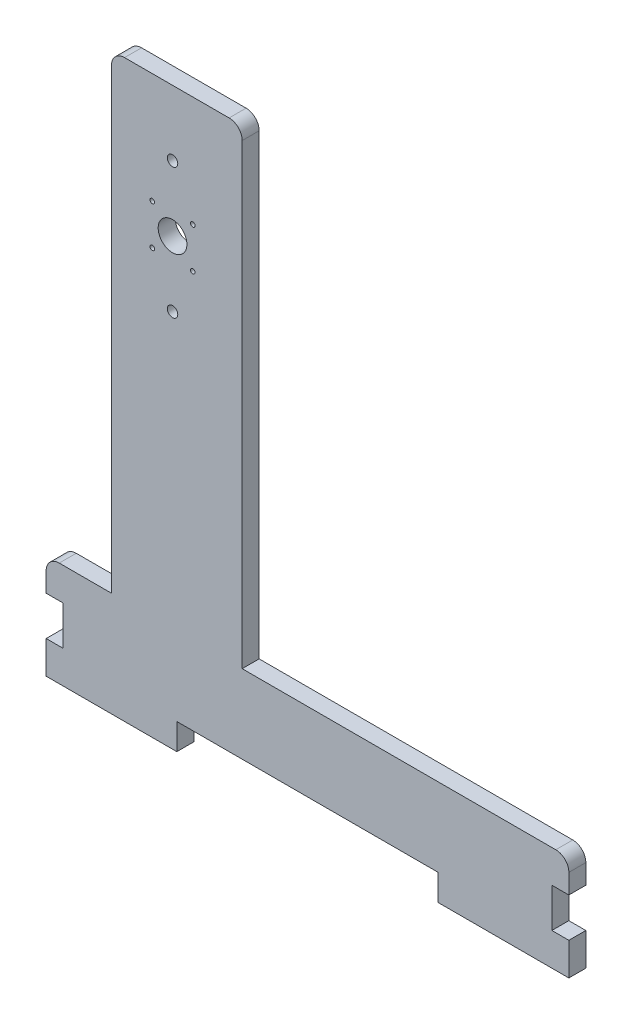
ISO-10303-21;
HEADER;
FILE_DESCRIPTION(('STEP AP214'),'2;1');
FILE_NAME('part.step','',(''),(''),'','','');
FILE_SCHEMA(('AUTOMOTIVE_DESIGN { 1 0 10303 214 1 1 1 1 }'));
ENDSEC;
DATA;
#1=APPLICATION_CONTEXT('core data for automotive mechanical design processes');
#2=APPLICATION_PROTOCOL_DEFINITION('international standard','automotive_design',2000,#1);
#3=PRODUCT_CONTEXT('',#1,'mechanical');
#4=PRODUCT('Part','Part','',(#3));
#5=PRODUCT_RELATED_PRODUCT_CATEGORY('part','',(#4));
#6=PRODUCT_DEFINITION_FORMATION('','',#4);
#7=PRODUCT_DEFINITION_CONTEXT('part definition',#1,'design');
#8=PRODUCT_DEFINITION('design','',#6,#7);
#9=PRODUCT_DEFINITION_SHAPE('','',#8);
#10=(LENGTH_UNIT() NAMED_UNIT(*) SI_UNIT(.MILLI.,.METRE.));
#11=(NAMED_UNIT(*) PLANE_ANGLE_UNIT() SI_UNIT($,.RADIAN.));
#12=(NAMED_UNIT(*) SI_UNIT($,.STERADIAN.) SOLID_ANGLE_UNIT());
#13=UNCERTAINTY_MEASURE_WITH_UNIT(LENGTH_MEASURE(1.E-05),#10,'distance_accuracy_value','');
#14=(GEOMETRIC_REPRESENTATION_CONTEXT(3) GLOBAL_UNCERTAINTY_ASSIGNED_CONTEXT((#13)) GLOBAL_UNIT_ASSIGNED_CONTEXT((#10,
#11,#12)) REPRESENTATION_CONTEXT('',''));
#15=CARTESIAN_POINT('',(0.,0.,0.));
#16=DIRECTION('',(0.,0.,1.));
#17=DIRECTION('',(1.,0.,0.));
#18=AXIS2_PLACEMENT_3D('',#15,#16,#17);
#19=CARTESIAN_POINT('',(-200.,-40.,13.));
#20=DIRECTION('',(1.,0.,0.));
#21=DIRECTION('',(0.,0.,-1.));
#22=AXIS2_PLACEMENT_3D('',#19,#20,#21);
#23=PLANE('',#22);
#24=DIRECTION('',(0.,-1.,0.));
#25=VECTOR('',#24,1.);
#26=CARTESIAN_POINT('',(-200.,-40.,0.));
#27=LINE('',#26,#25);
#28=CARTESIAN_POINT('',(-200.,30.,0.));
#29=VERTEX_POINT('',#28);
#30=CARTESIAN_POINT('',(-200.,15.,0.));
#31=VERTEX_POINT('',#30);
#32=EDGE_CURVE('E349',#29,#31,#27,.T.);
#33=ORIENTED_EDGE('',*,*,#32,.T.);
#34=DIRECTION('',(0.,0.,1.));
#35=VECTOR('',#34,1.);
#36=CARTESIAN_POINT('',(-200.,15.,0.));
#37=LINE('',#36,#35);
#38=CARTESIAN_POINT('',(-200.,15.,13.));
#39=VERTEX_POINT('',#38);
#40=EDGE_CURVE('E494',#31,#39,#37,.T.);
#41=ORIENTED_EDGE('',*,*,#40,.T.);
#42=DIRECTION('',(0.,-1.,0.));
#43=VECTOR('',#42,1.);
#44=CARTESIAN_POINT('',(-200.,-40.,13.));
#45=LINE('',#44,#43);
#46=CARTESIAN_POINT('',(-200.,30.,13.));
#47=VERTEX_POINT('',#46);
#48=EDGE_CURVE('E350',#47,#39,#45,.T.);
#49=ORIENTED_EDGE('',*,*,#48,.F.);
#50=DIRECTION('',(0.,0.,-1.));
#51=VECTOR('',#50,1.);
#52=CARTESIAN_POINT('',(-200.,30.,13.));
#53=LINE('',#52,#51);
#54=EDGE_CURVE('E314',#47,#29,#53,.T.);
#55=ORIENTED_EDGE('',*,*,#54,.T.);
#56=EDGE_LOOP('',(#33,#41,#49,#55));
#57=FACE_BOUND('',#56,.T.);
#58=ADVANCED_FACE('F43',(#57),#23,.F.);
#59=CARTESIAN_POINT('',(200.,-40.,13.));
#60=DIRECTION('',(-1.,0.,0.));
#61=DIRECTION('',(0.,0.,1.));
#62=AXIS2_PLACEMENT_3D('',#59,#60,#61);
#63=PLANE('',#62);
#64=DIRECTION('',(0.,1.,0.));
#65=VECTOR('',#64,1.);
#66=CARTESIAN_POINT('',(200.,-40.,0.));
#67=LINE('',#66,#65);
#68=CARTESIAN_POINT('',(200.,-40.,0.));
#69=VERTEX_POINT('',#68);
#70=CARTESIAN_POINT('',(200.,-15.,0.));
#71=VERTEX_POINT('',#70);
#72=EDGE_CURVE('E230',#69,#71,#67,.T.);
#73=ORIENTED_EDGE('',*,*,#72,.T.);
#74=DIRECTION('',(0.,0.,1.));
#75=VECTOR('',#74,1.);
#76=CARTESIAN_POINT('',(200.,-15.,0.));
#77=LINE('',#76,#75);
#78=CARTESIAN_POINT('',(200.,-15.,13.));
#79=VERTEX_POINT('',#78);
#80=EDGE_CURVE('E390',#71,#79,#77,.T.);
#81=ORIENTED_EDGE('',*,*,#80,.T.);
#82=DIRECTION('',(0.,1.,0.));
#83=VECTOR('',#82,1.);
#84=CARTESIAN_POINT('',(200.,-40.,13.));
#85=LINE('',#84,#83);
#86=CARTESIAN_POINT('',(200.,-40.,13.));
#87=VERTEX_POINT('',#86);
#88=EDGE_CURVE('E246',#87,#79,#85,.T.);
#89=ORIENTED_EDGE('',*,*,#88,.F.);
#90=DIRECTION('',(0.,0.,-1.));
#91=VECTOR('',#90,1.);
#92=CARTESIAN_POINT('',(200.,-40.,13.));
#93=LINE('',#92,#91);
#94=EDGE_CURVE('E241',#87,#69,#93,.T.);
#95=ORIENTED_EDGE('',*,*,#94,.T.);
#96=EDGE_LOOP('',(#73,#81,#89,#95));
#97=FACE_BOUND('',#96,.T.);
#98=ADVANCED_FACE('F388',(#97),#63,.F.);
#99=CARTESIAN_POINT('',(-50.0000000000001,40.,13.));
#100=DIRECTION('',(0.,-1.,0.));
#101=DIRECTION('',(0.,0.,-1.));
#102=AXIS2_PLACEMENT_3D('',#99,#100,#101);
#103=PLANE('',#102);
#104=DIRECTION('',(-1.,0.,0.));
#105=VECTOR('',#104,1.);
#106=CARTESIAN_POINT('',(-50.0000000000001,40.,13.));
#107=LINE('',#106,#105);
#108=CARTESIAN_POINT('',(190.,40.,13.));
#109=VERTEX_POINT('',#108);
#110=CARTESIAN_POINT('',(-50.0000000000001,40.,13.));
#111=VERTEX_POINT('',#110);
#112=EDGE_CURVE('E236',#109,#111,#107,.T.);
#113=ORIENTED_EDGE('',*,*,#112,.F.);
#114=DIRECTION('',(0.,0.,-1.));
#115=VECTOR('',#114,1.);
#116=CARTESIAN_POINT('',(190.,40.,13.));
#117=LINE('',#116,#115);
#118=CARTESIAN_POINT('',(190.,40.,0.));
#119=VERTEX_POINT('',#118);
#120=EDGE_CURVE('E302',#109,#119,#117,.T.);
#121=ORIENTED_EDGE('',*,*,#120,.T.);
#122=DIRECTION('',(-1.,0.,0.));
#123=VECTOR('',#122,1.);
#124=CARTESIAN_POINT('',(-50.0000000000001,40.,0.));
#125=LINE('',#124,#123);
#126=CARTESIAN_POINT('',(-50.0000000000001,40.,0.));
#127=VERTEX_POINT('',#126);
#128=EDGE_CURVE('E398',#119,#127,#125,.T.);
#129=ORIENTED_EDGE('',*,*,#128,.T.);
#130=DIRECTION('',(0.,0.,-1.));
#131=VECTOR('',#130,1.);
#132=CARTESIAN_POINT('',(-50.0000000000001,40.,13.));
#133=LINE('',#132,#131);
#134=EDGE_CURVE('E270',#111,#127,#133,.T.);
#135=ORIENTED_EDGE('',*,*,#134,.F.);
#136=EDGE_LOOP('',(#113,#121,#129,#135));
#137=FACE_BOUND('',#136,.T.);
#138=ADVANCED_FACE('F437',(#137),#103,.F.);
#139=CARTESIAN_POINT('',(-50.0000000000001,40.,13.));
#140=DIRECTION('',(-1.,0.,0.));
#141=DIRECTION('',(0.,0.,1.));
#142=AXIS2_PLACEMENT_3D('',#139,#140,#141);
#143=PLANE('',#142);
#144=DIRECTION('',(0.,1.,0.));
#145=VECTOR('',#144,1.);
#146=CARTESIAN_POINT('',(-50.0000000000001,40.,0.));
#147=LINE('',#146,#145);
#148=CARTESIAN_POINT('',(-50.0000000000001,390.,0.));
#149=VERTEX_POINT('',#148);
#150=EDGE_CURVE('E401',#127,#149,#147,.T.);
#151=ORIENTED_EDGE('',*,*,#150,.T.);
#152=DIRECTION('',(0.,0.,-1.));
#153=VECTOR('',#152,1.);
#154=CARTESIAN_POINT('',(-50.0000000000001,390.,13.));
#155=LINE('',#154,#153);
#156=CARTESIAN_POINT('',(-50.0000000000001,390.,13.));
#157=VERTEX_POINT('',#156);
#158=EDGE_CURVE('E296',#149,#157,#155,.F.);
#159=ORIENTED_EDGE('',*,*,#158,.T.);
#160=DIRECTION('',(0.,1.,0.));
#161=VECTOR('',#160,1.);
#162=CARTESIAN_POINT('',(-50.0000000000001,40.,13.));
#163=LINE('',#162,#161);
#164=EDGE_CURVE('E434',#111,#157,#163,.T.);
#165=ORIENTED_EDGE('',*,*,#164,.F.);
#166=ORIENTED_EDGE('',*,*,#134,.T.);
#167=EDGE_LOOP('',(#151,#159,#165,#166));
#168=FACE_BOUND('',#167,.T.);
#169=ADVANCED_FACE('F430',(#168),#143,.F.);
#170=CARTESIAN_POINT('',(-150.,400.,13.));
#171=DIRECTION('',(0.,-1.,0.));
#172=DIRECTION('',(0.,0.,-1.));
#173=AXIS2_PLACEMENT_3D('',#170,#171,#172);
#174=PLANE('',#173);
#175=DIRECTION('',(-1.,0.,0.));
#176=VECTOR('',#175,1.);
#177=CARTESIAN_POINT('',(-150.,400.,13.));
#178=LINE('',#177,#176);
#179=CARTESIAN_POINT('',(-60.0000000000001,400.,13.));
#180=VERTEX_POINT('',#179);
#181=CARTESIAN_POINT('',(-140.,400.,13.));
#182=VERTEX_POINT('',#181);
#183=EDGE_CURVE('E422',#180,#182,#178,.T.);
#184=ORIENTED_EDGE('',*,*,#183,.F.);
#185=DIRECTION('',(0.,0.,-1.));
#186=VECTOR('',#185,1.);
#187=CARTESIAN_POINT('',(-60.0000000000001,400.,13.));
#188=LINE('',#187,#186);
#189=CARTESIAN_POINT('',(-60.0000000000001,400.,0.));
#190=VERTEX_POINT('',#189);
#191=EDGE_CURVE('E289',#180,#190,#188,.T.);
#192=ORIENTED_EDGE('',*,*,#191,.T.);
#193=DIRECTION('',(-1.,0.,0.));
#194=VECTOR('',#193,1.);
#195=CARTESIAN_POINT('',(-150.,400.,0.));
#196=LINE('',#195,#194);
#197=CARTESIAN_POINT('',(-140.,400.,0.));
#198=VERTEX_POINT('',#197);
#199=EDGE_CURVE('E405',#190,#198,#196,.T.);
#200=ORIENTED_EDGE('',*,*,#199,.T.);
#201=DIRECTION('',(0.,0.,-1.));
#202=VECTOR('',#201,1.);
#203=CARTESIAN_POINT('',(-140.,400.,13.));
#204=LINE('',#203,#202);
#205=EDGE_CURVE('E282',#198,#182,#204,.F.);
#206=ORIENTED_EDGE('',*,*,#205,.T.);
#207=EDGE_LOOP('',(#184,#192,#200,#206));
#208=FACE_BOUND('',#207,.T.);
#209=ADVANCED_FACE('F421',(#208),#174,.F.);
#210=CARTESIAN_POINT('',(-150.,40.,13.));
#211=DIRECTION('',(1.,0.,0.));
#212=DIRECTION('',(0.,0.,-1.));
#213=AXIS2_PLACEMENT_3D('',#210,#211,#212);
#214=PLANE('',#213);
#215=DIRECTION('',(0.,-1.,0.));
#216=VECTOR('',#215,1.);
#217=CARTESIAN_POINT('',(-150.,40.,13.));
#218=LINE('',#217,#216);
#219=CARTESIAN_POINT('',(-150.,390.,13.));
#220=VERTEX_POINT('',#219);
#221=CARTESIAN_POINT('',(-150.,40.,13.));
#222=VERTEX_POINT('',#221);
#223=EDGE_CURVE('E339',#220,#222,#218,.T.);
#224=ORIENTED_EDGE('',*,*,#223,.F.);
#225=DIRECTION('',(0.,0.,-1.));
#226=VECTOR('',#225,1.);
#227=CARTESIAN_POINT('',(-150.,390.,13.));
#228=LINE('',#227,#226);
#229=CARTESIAN_POINT('',(-150.,390.,0.));
#230=VERTEX_POINT('',#229);
#231=EDGE_CURVE('E274',#220,#230,#228,.T.);
#232=ORIENTED_EDGE('',*,*,#231,.T.);
#233=DIRECTION('',(0.,-1.,0.));
#234=VECTOR('',#233,1.);
#235=CARTESIAN_POINT('',(-150.,40.,0.));
#236=LINE('',#235,#234);
#237=CARTESIAN_POINT('',(-150.,40.,0.));
#238=VERTEX_POINT('',#237);
#239=EDGE_CURVE('E407',#230,#238,#236,.T.);
#240=ORIENTED_EDGE('',*,*,#239,.T.);
#241=DIRECTION('',(0.,0.,-1.));
#242=VECTOR('',#241,1.);
#243=CARTESIAN_POINT('',(-150.,40.,13.));
#244=LINE('',#243,#242);
#245=EDGE_CURVE('E266',#222,#238,#244,.T.);
#246=ORIENTED_EDGE('',*,*,#245,.F.);
#247=EDGE_LOOP('',(#224,#232,#240,#246));
#248=FACE_BOUND('',#247,.T.);
#249=ADVANCED_FACE('F412',(#248),#214,.F.);
#250=CARTESIAN_POINT('',(-200.,40.,13.));
#251=DIRECTION('',(0.,-1.,0.));
#252=DIRECTION('',(0.,0.,-1.));
#253=AXIS2_PLACEMENT_3D('',#250,#251,#252);
#254=PLANE('',#253);
#255=DIRECTION('',(-1.,0.,0.));
#256=VECTOR('',#255,1.);
#257=CARTESIAN_POINT('',(-200.,40.,0.));
#258=LINE('',#257,#256);
#259=CARTESIAN_POINT('',(-190.,40.,0.));
#260=VERTEX_POINT('',#259);
#261=EDGE_CURVE('E329',#238,#260,#258,.T.);
#262=ORIENTED_EDGE('',*,*,#261,.T.);
#263=DIRECTION('',(0.,0.,-1.));
#264=VECTOR('',#263,1.);
#265=CARTESIAN_POINT('',(-190.,40.,13.));
#266=LINE('',#265,#264);
#267=CARTESIAN_POINT('',(-190.,40.,13.));
#268=VERTEX_POINT('',#267);
#269=EDGE_CURVE('E52',#260,#268,#266,.F.);
#270=ORIENTED_EDGE('',*,*,#269,.T.);
#271=DIRECTION('',(-1.,0.,0.));
#272=VECTOR('',#271,1.);
#273=CARTESIAN_POINT('',(-200.,40.,13.));
#274=LINE('',#273,#272);
#275=EDGE_CURVE('E327',#222,#268,#274,.T.);
#276=ORIENTED_EDGE('',*,*,#275,.F.);
#277=ORIENTED_EDGE('',*,*,#245,.T.);
#278=EDGE_LOOP('',(#262,#270,#276,#277));
#279=FACE_BOUND('',#278,.T.);
#280=ADVANCED_FACE('F326',(#279),#254,.F.);
#281=CARTESIAN_POINT('',(-200.,-15.,13.));
#282=VERTEX_POINT('',#281);
#283=CARTESIAN_POINT('',(-200.,-40.,13.));
#284=VERTEX_POINT('',#283);
#285=EDGE_CURVE('E342',#282,#284,#45,.T.);
#286=ORIENTED_EDGE('',*,*,#285,.F.);
#287=DIRECTION('',(0.,0.,1.));
#288=VECTOR('',#287,1.);
#289=CARTESIAN_POINT('',(-200.,-15.,0.));
#290=LINE('',#289,#288);
#291=CARTESIAN_POINT('',(-200.,-15.,0.));
#292=VERTEX_POINT('',#291);
#293=EDGE_CURVE('E497',#292,#282,#290,.T.);
#294=ORIENTED_EDGE('',*,*,#293,.F.);
#295=CARTESIAN_POINT('',(-200.,-40.,0.));
#296=VERTEX_POINT('',#295);
#297=EDGE_CURVE('E356',#292,#296,#27,.T.);
#298=ORIENTED_EDGE('',*,*,#297,.T.);
#299=DIRECTION('',(0.,0.,-1.));
#300=VECTOR('',#299,1.);
#301=CARTESIAN_POINT('',(-200.,-40.,13.));
#302=LINE('',#301,#300);
#303=EDGE_CURVE('E262',#284,#296,#302,.T.);
#304=ORIENTED_EDGE('',*,*,#303,.F.);
#305=EDGE_LOOP('',(#286,#294,#298,#304));
#306=FACE_BOUND('',#305,.T.);
#307=ADVANCED_FACE('F587',(#306),#23,.F.);
#308=CARTESIAN_POINT('',(-200.,-40.,13.));
#309=DIRECTION('',(0.,1.,0.));
#310=DIRECTION('',(-1.,0.,0.));
#311=AXIS2_PLACEMENT_3D('',#308,#309,#310);
#312=PLANE('',#311);
#313=DIRECTION('',(1.,0.,0.));
#314=VECTOR('',#313,1.);
#315=CARTESIAN_POINT('',(-200.,-40.,0.));
#316=LINE('',#315,#314);
#317=CARTESIAN_POINT('',(-100.,-40.,0.));
#318=VERTEX_POINT('',#317);
#319=EDGE_CURVE('E355',#296,#318,#316,.T.);
#320=ORIENTED_EDGE('',*,*,#319,.T.);
#321=DIRECTION('',(0.,0.,-1.));
#322=VECTOR('',#321,1.);
#323=CARTESIAN_POINT('',(-100.,-40.,13.));
#324=LINE('',#323,#322);
#325=CARTESIAN_POINT('',(-100.,-40.,13.));
#326=VERTEX_POINT('',#325);
#327=EDGE_CURVE('E258',#326,#318,#324,.T.);
#328=ORIENTED_EDGE('',*,*,#327,.F.);
#329=DIRECTION('',(1.,0.,0.));
#330=VECTOR('',#329,1.);
#331=CARTESIAN_POINT('',(-200.,-40.,13.));
#332=LINE('',#331,#330);
#333=EDGE_CURVE('E559',#284,#326,#332,.T.);
#334=ORIENTED_EDGE('',*,*,#333,.F.);
#335=ORIENTED_EDGE('',*,*,#303,.T.);
#336=EDGE_LOOP('',(#320,#328,#334,#335));
#337=FACE_BOUND('',#336,.T.);
#338=ADVANCED_FACE('F583',(#337),#312,.F.);
#339=CARTESIAN_POINT('',(-100.,-40.,13.));
#340=DIRECTION('',(-1.,0.,0.));
#341=DIRECTION('',(0.,-1.,0.));
#342=AXIS2_PLACEMENT_3D('',#339,#340,#341);
#343=PLANE('',#342);
#344=DIRECTION('',(0.,1.,0.));
#345=VECTOR('',#344,1.);
#346=CARTESIAN_POINT('',(-100.,-40.,0.));
#347=LINE('',#346,#345);
#348=CARTESIAN_POINT('',(-100.,-20.,0.));
#349=VERTEX_POINT('',#348);
#350=EDGE_CURVE('E360',#318,#349,#347,.T.);
#351=ORIENTED_EDGE('',*,*,#350,.T.);
#352=DIRECTION('',(0.,0.,-1.));
#353=VECTOR('',#352,1.);
#354=CARTESIAN_POINT('',(-100.,-20.,13.));
#355=LINE('',#354,#353);
#356=CARTESIAN_POINT('',(-100.,-20.,13.));
#357=VERTEX_POINT('',#356);
#358=EDGE_CURVE('E254',#357,#349,#355,.T.);
#359=ORIENTED_EDGE('',*,*,#358,.F.);
#360=DIRECTION('',(0.,1.,0.));
#361=VECTOR('',#360,1.);
#362=CARTESIAN_POINT('',(-100.,-40.,13.));
#363=LINE('',#362,#361);
#364=EDGE_CURVE('E562',#326,#357,#363,.T.);
#365=ORIENTED_EDGE('',*,*,#364,.F.);
#366=ORIENTED_EDGE('',*,*,#327,.T.);
#367=EDGE_LOOP('',(#351,#359,#365,#366));
#368=FACE_BOUND('',#367,.T.);
#369=ADVANCED_FACE('F579',(#368),#343,.F.);
#370=CARTESIAN_POINT('',(-100.,-20.,13.));
#371=DIRECTION('',(0.,1.,0.));
#372=DIRECTION('',(0.,0.,1.));
#373=AXIS2_PLACEMENT_3D('',#370,#371,#372);
#374=PLANE('',#373);
#375=DIRECTION('',(1.,0.,0.));
#376=VECTOR('',#375,1.);
#377=CARTESIAN_POINT('',(-100.,-20.,0.));
#378=LINE('',#377,#376);
#379=CARTESIAN_POINT('',(99.9999999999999,-20.,0.));
#380=VERTEX_POINT('',#379);
#381=EDGE_CURVE('E367',#349,#380,#378,.T.);
#382=ORIENTED_EDGE('',*,*,#381,.T.);
#383=DIRECTION('',(0.,0.,-1.));
#384=VECTOR('',#383,1.);
#385=CARTESIAN_POINT('',(99.9999999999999,-20.,13.));
#386=LINE('',#385,#384);
#387=CARTESIAN_POINT('',(99.9999999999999,-20.,13.));
#388=VERTEX_POINT('',#387);
#389=EDGE_CURVE('E250',#388,#380,#386,.T.);
#390=ORIENTED_EDGE('',*,*,#389,.F.);
#391=DIRECTION('',(1.,0.,0.));
#392=VECTOR('',#391,1.);
#393=CARTESIAN_POINT('',(-100.,-20.,13.));
#394=LINE('',#393,#392);
#395=EDGE_CURVE('E565',#357,#388,#394,.T.);
#396=ORIENTED_EDGE('',*,*,#395,.F.);
#397=ORIENTED_EDGE('',*,*,#358,.T.);
#398=EDGE_LOOP('',(#382,#390,#396,#397));
#399=FACE_BOUND('',#398,.T.);
#400=ADVANCED_FACE('F574',(#399),#374,.F.);
#401=CARTESIAN_POINT('',(100.,-40.,13.));
#402=DIRECTION('',(1.,0.,0.));
#403=DIRECTION('',(0.,1.,0.));
#404=AXIS2_PLACEMENT_3D('',#401,#402,#403);
#405=PLANE('',#404);
#406=DIRECTION('',(0.,-1.,0.));
#407=VECTOR('',#406,1.);
#408=CARTESIAN_POINT('',(100.,-40.,0.));
#409=LINE('',#408,#407);
#410=CARTESIAN_POINT('',(100.,-40.,0.));
#411=VERTEX_POINT('',#410);
#412=EDGE_CURVE('E237',#380,#411,#409,.T.);
#413=ORIENTED_EDGE('',*,*,#412,.T.);
#414=DIRECTION('',(0.,0.,-1.));
#415=VECTOR('',#414,1.);
#416=CARTESIAN_POINT('',(100.,-40.,13.));
#417=LINE('',#416,#415);
#418=CARTESIAN_POINT('',(100.,-40.,13.));
#419=VERTEX_POINT('',#418);
#420=EDGE_CURVE('E245',#419,#411,#417,.T.);
#421=ORIENTED_EDGE('',*,*,#420,.F.);
#422=DIRECTION('',(0.,-1.,0.));
#423=VECTOR('',#422,1.);
#424=CARTESIAN_POINT('',(100.,-40.,13.));
#425=LINE('',#424,#423);
#426=EDGE_CURVE('E567',#388,#419,#425,.T.);
#427=ORIENTED_EDGE('',*,*,#426,.F.);
#428=ORIENTED_EDGE('',*,*,#389,.T.);
#429=EDGE_LOOP('',(#413,#421,#427,#428));
#430=FACE_BOUND('',#429,.T.);
#431=ADVANCED_FACE('F373',(#430),#405,.F.);
#432=CARTESIAN_POINT('',(100.,-40.,13.));
#433=DIRECTION('',(0.,1.,0.));
#434=DIRECTION('',(-1.,0.,0.));
#435=AXIS2_PLACEMENT_3D('',#432,#433,#434);
#436=PLANE('',#435);
#437=DIRECTION('',(1.,0.,0.));
#438=VECTOR('',#437,1.);
#439=CARTESIAN_POINT('',(100.,-40.,0.));
#440=LINE('',#439,#438);
#441=EDGE_CURVE('E231',#411,#69,#440,.T.);
#442=ORIENTED_EDGE('',*,*,#441,.T.);
#443=ORIENTED_EDGE('',*,*,#94,.F.);
#444=DIRECTION('',(1.,0.,0.));
#445=VECTOR('',#444,1.);
#446=CARTESIAN_POINT('',(100.,-40.,13.));
#447=LINE('',#446,#445);
#448=EDGE_CURVE('E382',#419,#87,#447,.T.);
#449=ORIENTED_EDGE('',*,*,#448,.F.);
#450=ORIENTED_EDGE('',*,*,#420,.T.);
#451=EDGE_LOOP('',(#442,#443,#449,#450));
#452=FACE_BOUND('',#451,.T.);
#453=ADVANCED_FACE('F380',(#452),#436,.F.);
#454=CARTESIAN_POINT('',(200.,15.,13.));
#455=VERTEX_POINT('',#454);
#456=CARTESIAN_POINT('',(200.,30.,13.));
#457=VERTEX_POINT('',#456);
#458=EDGE_CURVE('E221',#455,#457,#85,.T.);
#459=ORIENTED_EDGE('',*,*,#458,.F.);
#460=DIRECTION('',(0.,0.,1.));
#461=VECTOR('',#460,1.);
#462=CARTESIAN_POINT('',(200.,15.,0.));
#463=LINE('',#462,#461);
#464=CARTESIAN_POINT('',(200.,15.,0.));
#465=VERTEX_POINT('',#464);
#466=EDGE_CURVE('E207',#465,#455,#463,.T.);
#467=ORIENTED_EDGE('',*,*,#466,.F.);
#468=CARTESIAN_POINT('',(200.,30.,0.));
#469=VERTEX_POINT('',#468);
#470=EDGE_CURVE('E219',#465,#469,#67,.T.);
#471=ORIENTED_EDGE('',*,*,#470,.T.);
#472=DIRECTION('',(0.,0.,-1.));
#473=VECTOR('',#472,1.);
#474=CARTESIAN_POINT('',(200.,30.,13.));
#475=LINE('',#474,#473);
#476=EDGE_CURVE('E308',#469,#457,#475,.F.);
#477=ORIENTED_EDGE('',*,*,#476,.T.);
#478=EDGE_LOOP('',(#459,#467,#471,#477));
#479=FACE_BOUND('',#478,.T.);
#480=ADVANCED_FACE('F217',(#479),#63,.F.);
#481=CARTESIAN_POINT('',(0.,0.,13.));
#482=DIRECTION('',(0.,0.,1.));
#483=DIRECTION('',(1.,0.,0.));
#484=AXIS2_PLACEMENT_3D('',#481,#482,#483);
#485=PLANE('',#484);
#486=DIRECTION('',(1.,0.,0.));
#487=VECTOR('',#486,1.);
#488=CARTESIAN_POINT('',(200.,-15.,13.));
#489=LINE('',#488,#487);
#490=CARTESIAN_POINT('',(187.,-15.,13.));
#491=VERTEX_POINT('',#490);
#492=EDGE_CURVE('E213',#491,#79,#489,.T.);
#493=ORIENTED_EDGE('',*,*,#492,.F.);
#494=DIRECTION('',(0.,-1.,0.));
#495=VECTOR('',#494,1.);
#496=CARTESIAN_POINT('',(187.,15.,13.));
#497=LINE('',#496,#495);
#498=CARTESIAN_POINT('',(187.,15.,13.));
#499=VERTEX_POINT('',#498);
#500=EDGE_CURVE('E445',#499,#491,#497,.T.);
#501=ORIENTED_EDGE('',*,*,#500,.F.);
#502=DIRECTION('',(-1.,0.,0.));
#503=VECTOR('',#502,1.);
#504=CARTESIAN_POINT('',(200.,15.,13.));
#505=LINE('',#504,#503);
#506=EDGE_CURVE('E443',#455,#499,#505,.T.);
#507=ORIENTED_EDGE('',*,*,#506,.F.);
#508=ORIENTED_EDGE('',*,*,#458,.T.);
#509=CARTESIAN_POINT('',(190.,30.,13.));
#510=DIRECTION('',(0.,0.,1.));
#511=DIRECTION('',(1.,0.,0.));
#512=AXIS2_PLACEMENT_3D('',#509,#510,#511);
#513=CIRCLE('',#512,10.);
#514=EDGE_CURVE('E311',#457,#109,#513,.T.);
#515=ORIENTED_EDGE('',*,*,#514,.T.);
#516=ORIENTED_EDGE('',*,*,#112,.T.);
#517=ORIENTED_EDGE('',*,*,#164,.T.);
#518=CARTESIAN_POINT('',(-60.0000000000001,390.,13.));
#519=DIRECTION('',(0.,0.,1.));
#520=DIRECTION('',(1.,0.,0.));
#521=AXIS2_PLACEMENT_3D('',#518,#519,#520);
#522=CIRCLE('',#521,10.);
#523=EDGE_CURVE('E299',#157,#180,#522,.T.);
#524=ORIENTED_EDGE('',*,*,#523,.T.);
#525=ORIENTED_EDGE('',*,*,#183,.T.);
#526=CARTESIAN_POINT('',(-140.,390.,13.));
#527=DIRECTION('',(0.,0.,1.));
#528=DIRECTION('',(1.,0.,0.));
#529=AXIS2_PLACEMENT_3D('',#526,#527,#528);
#530=CIRCLE('',#529,10.);
#531=EDGE_CURVE('E286',#182,#220,#530,.T.);
#532=ORIENTED_EDGE('',*,*,#531,.T.);
#533=ORIENTED_EDGE('',*,*,#223,.T.);
#534=ORIENTED_EDGE('',*,*,#275,.T.);
#535=CARTESIAN_POINT('',(-190.,30.,13.));
#536=DIRECTION('',(0.,0.,1.));
#537=DIRECTION('',(1.,0.,0.));
#538=AXIS2_PLACEMENT_3D('',#535,#536,#537);
#539=CIRCLE('',#538,10.);
#540=EDGE_CURVE('E11',#268,#47,#539,.T.);
#541=ORIENTED_EDGE('',*,*,#540,.T.);
#542=ORIENTED_EDGE('',*,*,#48,.T.);
#543=DIRECTION('',(-1.,0.,0.));
#544=VECTOR('',#543,1.);
#545=CARTESIAN_POINT('',(-200.,15.,13.));
#546=LINE('',#545,#544);
#547=CARTESIAN_POINT('',(-187.,15.,13.));
#548=VERTEX_POINT('',#547);
#549=EDGE_CURVE('E493',#548,#39,#546,.T.);
#550=ORIENTED_EDGE('',*,*,#549,.F.);
#551=DIRECTION('',(0.,1.,0.));
#552=VECTOR('',#551,1.);
#553=CARTESIAN_POINT('',(-187.,15.,13.));
#554=LINE('',#553,#552);
#555=CARTESIAN_POINT('',(-187.,-15.,13.));
#556=VERTEX_POINT('',#555);
#557=EDGE_CURVE('E505',#556,#548,#554,.T.);
#558=ORIENTED_EDGE('',*,*,#557,.F.);
#559=DIRECTION('',(1.,0.,0.));
#560=VECTOR('',#559,1.);
#561=CARTESIAN_POINT('',(-200.,-15.,13.));
#562=LINE('',#561,#560);
#563=EDGE_CURVE('E509',#282,#556,#562,.T.);
#564=ORIENTED_EDGE('',*,*,#563,.F.);
#565=ORIENTED_EDGE('',*,*,#285,.T.);
#566=ORIENTED_EDGE('',*,*,#333,.T.);
#567=ORIENTED_EDGE('',*,*,#364,.T.);
#568=ORIENTED_EDGE('',*,*,#395,.T.);
#569=ORIENTED_EDGE('',*,*,#426,.T.);
#570=ORIENTED_EDGE('',*,*,#448,.T.);
#571=ORIENTED_EDGE('',*,*,#88,.T.);
#572=EDGE_LOOP('',(#493,#501,#507,#508,#515,#516,#517,#524,#525,#532,#533,#534,#541,#542,#550,
#558,#564,#565,#566,#567,#568,#569,#570,#571));
#573=FACE_BOUND('',#572,.T.);
#574=CARTESIAN_POINT('',(-103.286771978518,350.,13.));
#575=DIRECTION('',(0.,0.,1.));
#576=DIRECTION('',(1.,0.,0.));
#577=AXIS2_PLACEMENT_3D('',#574,#575,#576);
#578=CIRCLE('',#577,4.00000000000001);
#579=CARTESIAN_POINT('',(-99.2867719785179,350.,13.));
#580=VERTEX_POINT('',#579);
#581=EDGE_CURVE('E484',#580,#580,#578,.T.);
#582=ORIENTED_EDGE('',*,*,#581,.F.);
#583=EDGE_LOOP('',(#582));
#584=FACE_BOUND('',#583,.T.);
#585=CARTESIAN_POINT('',(-103.286771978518,250.,13.));
#586=DIRECTION('',(0.,0.,1.));
#587=DIRECTION('',(1.,0.,0.));
#588=AXIS2_PLACEMENT_3D('',#585,#586,#587);
#589=CIRCLE('',#588,4.00000000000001);
#590=CARTESIAN_POINT('',(-99.2867719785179,250.,13.));
#591=VERTEX_POINT('',#590);
#592=EDGE_CURVE('E467',#591,#591,#589,.T.);
#593=ORIENTED_EDGE('',*,*,#592,.F.);
#594=EDGE_LOOP('',(#593));
#595=FACE_BOUND('',#594,.T.);
#596=CARTESIAN_POINT('',(-103.286771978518,300.,13.));
#597=DIRECTION('',(0.,0.,1.));
#598=DIRECTION('',(1.,0.,0.));
#599=AXIS2_PLACEMENT_3D('',#596,#597,#598);
#600=CIRCLE('',#599,11.);
#601=CARTESIAN_POINT('',(-92.2867719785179,300.,13.));
#602=VERTEX_POINT('',#601);
#603=EDGE_CURVE('E476',#602,#602,#600,.T.);
#604=ORIENTED_EDGE('',*,*,#603,.F.);
#605=EDGE_LOOP('',(#604));
#606=FACE_BOUND('',#605,.T.);
#607=CARTESIAN_POINT('',(-118.786771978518,284.5,13.));
#608=DIRECTION('',(0.,0.,1.));
#609=DIRECTION('',(1.,0.,0.));
#610=AXIS2_PLACEMENT_3D('',#607,#608,#609);
#611=CIRCLE('',#610,1.75);
#612=CARTESIAN_POINT('',(-117.036771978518,284.5,13.));
#613=VERTEX_POINT('',#612);
#614=EDGE_CURVE('E542',#613,#613,#611,.T.);
#615=ORIENTED_EDGE('',*,*,#614,.F.);
#616=EDGE_LOOP('',(#615));
#617=FACE_BOUND('',#616,.T.);
#618=CARTESIAN_POINT('',(-87.7867719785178,284.5,13.));
#619=DIRECTION('',(0.,0.,1.));
#620=DIRECTION('',(1.,0.,0.));
#621=AXIS2_PLACEMENT_3D('',#618,#619,#620);
#622=CIRCLE('',#621,1.75);
#623=CARTESIAN_POINT('',(-86.0367719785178,284.5,13.));
#624=VERTEX_POINT('',#623);
#625=EDGE_CURVE('E534',#624,#624,#622,.T.);
#626=ORIENTED_EDGE('',*,*,#625,.F.);
#627=EDGE_LOOP('',(#626));
#628=FACE_BOUND('',#627,.T.);
#629=CARTESIAN_POINT('',(-87.7867719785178,315.5,13.));
#630=DIRECTION('',(0.,0.,1.));
#631=DIRECTION('',(1.,0.,0.));
#632=AXIS2_PLACEMENT_3D('',#629,#630,#631);
#633=CIRCLE('',#632,1.75);
#634=CARTESIAN_POINT('',(-86.0367719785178,315.5,13.));
#635=VERTEX_POINT('',#634);
#636=EDGE_CURVE('E526',#635,#635,#633,.T.);
#637=ORIENTED_EDGE('',*,*,#636,.F.);
#638=EDGE_LOOP('',(#637));
#639=FACE_BOUND('',#638,.T.);
#640=CARTESIAN_POINT('',(-118.786771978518,315.5,13.));
#641=DIRECTION('',(0.,0.,1.));
#642=DIRECTION('',(1.,0.,0.));
#643=AXIS2_PLACEMENT_3D('',#640,#641,#642);
#644=CIRCLE('',#643,1.75);
#645=CARTESIAN_POINT('',(-117.036771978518,315.5,13.));
#646=VERTEX_POINT('',#645);
#647=EDGE_CURVE('E447',#646,#646,#644,.T.);
#648=ORIENTED_EDGE('',*,*,#647,.F.);
#649=EDGE_LOOP('',(#648));
#650=FACE_BOUND('',#649,.T.);
#651=ADVANCED_FACE('F334',(#573,#584,#595,#606,#617,#628,#639,#650),#485,.T.);
#652=CARTESIAN_POINT('',(0.,0.,0.));
#653=DIRECTION('',(0.,0.,1.));
#654=DIRECTION('',(1.,0.,0.));
#655=AXIS2_PLACEMENT_3D('',#652,#653,#654);
#656=PLANE('',#655);
#657=CARTESIAN_POINT('',(-103.286771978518,350.,0.));
#658=DIRECTION('',(0.,0.,1.));
#659=DIRECTION('',(1.,0.,0.));
#660=AXIS2_PLACEMENT_3D('',#657,#658,#659);
#661=CIRCLE('',#660,4.00000000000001);
#662=CARTESIAN_POINT('',(-99.2867719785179,350.,0.));
#663=VERTEX_POINT('',#662);
#664=EDGE_CURVE('E489',#663,#663,#661,.T.);
#665=ORIENTED_EDGE('',*,*,#664,.T.);
#666=EDGE_LOOP('',(#665));
#667=FACE_BOUND('',#666,.T.);
#668=CARTESIAN_POINT('',(-103.286771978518,250.,0.));
#669=DIRECTION('',(0.,0.,1.));
#670=DIRECTION('',(1.,0.,0.));
#671=AXIS2_PLACEMENT_3D('',#668,#669,#670);
#672=CIRCLE('',#671,4.00000000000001);
#673=CARTESIAN_POINT('',(-99.2867719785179,250.,0.));
#674=VERTEX_POINT('',#673);
#675=EDGE_CURVE('E472',#674,#674,#672,.T.);
#676=ORIENTED_EDGE('',*,*,#675,.T.);
#677=EDGE_LOOP('',(#676));
#678=FACE_BOUND('',#677,.T.);
#679=CARTESIAN_POINT('',(-103.286771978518,300.,0.));
#680=DIRECTION('',(0.,0.,1.));
#681=DIRECTION('',(1.,0.,0.));
#682=AXIS2_PLACEMENT_3D('',#679,#680,#681);
#683=CIRCLE('',#682,11.);
#684=CARTESIAN_POINT('',(-92.2867719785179,300.,0.));
#685=VERTEX_POINT('',#684);
#686=EDGE_CURVE('E480',#685,#685,#683,.T.);
#687=ORIENTED_EDGE('',*,*,#686,.T.);
#688=EDGE_LOOP('',(#687));
#689=FACE_BOUND('',#688,.T.);
#690=CARTESIAN_POINT('',(-118.786771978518,284.5,0.));
#691=DIRECTION('',(0.,0.,1.));
#692=DIRECTION('',(1.,0.,0.));
#693=AXIS2_PLACEMENT_3D('',#690,#691,#692);
#694=CIRCLE('',#693,1.75);
#695=CARTESIAN_POINT('',(-117.036771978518,284.5,0.));
#696=VERTEX_POINT('',#695);
#697=EDGE_CURVE('E488',#696,#696,#694,.T.);
#698=ORIENTED_EDGE('',*,*,#697,.T.);
#699=EDGE_LOOP('',(#698));
#700=FACE_BOUND('',#699,.T.);
#701=CARTESIAN_POINT('',(-87.7867719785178,284.5,0.));
#702=DIRECTION('',(0.,0.,1.));
#703=DIRECTION('',(1.,0.,0.));
#704=AXIS2_PLACEMENT_3D('',#701,#702,#703);
#705=CIRCLE('',#704,1.75);
#706=CARTESIAN_POINT('',(-86.0367719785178,284.5,0.));
#707=VERTEX_POINT('',#706);
#708=EDGE_CURVE('E538',#707,#707,#705,.T.);
#709=ORIENTED_EDGE('',*,*,#708,.T.);
#710=EDGE_LOOP('',(#709));
#711=FACE_BOUND('',#710,.T.);
#712=CARTESIAN_POINT('',(-87.7867719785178,315.5,0.));
#713=DIRECTION('',(0.,0.,1.));
#714=DIRECTION('',(1.,0.,0.));
#715=AXIS2_PLACEMENT_3D('',#712,#713,#714);
#716=CIRCLE('',#715,1.75);
#717=CARTESIAN_POINT('',(-86.0367719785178,315.5,0.));
#718=VERTEX_POINT('',#717);
#719=EDGE_CURVE('E530',#718,#718,#716,.T.);
#720=ORIENTED_EDGE('',*,*,#719,.T.);
#721=EDGE_LOOP('',(#720));
#722=FACE_BOUND('',#721,.T.);
#723=CARTESIAN_POINT('',(-118.786771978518,315.5,0.));
#724=DIRECTION('',(0.,0.,1.));
#725=DIRECTION('',(1.,0.,0.));
#726=AXIS2_PLACEMENT_3D('',#723,#724,#725);
#727=CIRCLE('',#726,1.75);
#728=CARTESIAN_POINT('',(-117.036771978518,315.5,0.));
#729=VERTEX_POINT('',#728);
#730=EDGE_CURVE('E453',#729,#729,#727,.T.);
#731=ORIENTED_EDGE('',*,*,#730,.T.);
#732=EDGE_LOOP('',(#731));
#733=FACE_BOUND('',#732,.T.);
#734=DIRECTION('',(0.,-1.,0.));
#735=VECTOR('',#734,1.);
#736=CARTESIAN_POINT('',(187.,15.,0.));
#737=LINE('',#736,#735);
#738=CARTESIAN_POINT('',(187.,15.,0.));
#739=VERTEX_POINT('',#738);
#740=CARTESIAN_POINT('',(187.,-15.,0.));
#741=VERTEX_POINT('',#740);
#742=EDGE_CURVE('E59',#739,#741,#737,.T.);
#743=ORIENTED_EDGE('',*,*,#742,.T.);
#744=DIRECTION('',(1.,0.,0.));
#745=VECTOR('',#744,1.);
#746=CARTESIAN_POINT('',(200.,-15.,0.));
#747=LINE('',#746,#745);
#748=EDGE_CURVE('E223',#741,#71,#747,.T.);
#749=ORIENTED_EDGE('',*,*,#748,.T.);
#750=ORIENTED_EDGE('',*,*,#72,.F.);
#751=ORIENTED_EDGE('',*,*,#441,.F.);
#752=ORIENTED_EDGE('',*,*,#412,.F.);
#753=ORIENTED_EDGE('',*,*,#381,.F.);
#754=ORIENTED_EDGE('',*,*,#350,.F.);
#755=ORIENTED_EDGE('',*,*,#319,.F.);
#756=ORIENTED_EDGE('',*,*,#297,.F.);
#757=DIRECTION('',(1.,0.,0.));
#758=VECTOR('',#757,1.);
#759=CARTESIAN_POINT('',(-200.,-15.,0.));
#760=LINE('',#759,#758);
#761=CARTESIAN_POINT('',(-187.,-15.,0.));
#762=VERTEX_POINT('',#761);
#763=EDGE_CURVE('E517',#292,#762,#760,.T.);
#764=ORIENTED_EDGE('',*,*,#763,.T.);
#765=DIRECTION('',(0.,1.,0.));
#766=VECTOR('',#765,1.);
#767=CARTESIAN_POINT('',(-187.,15.,0.));
#768=LINE('',#767,#766);
#769=CARTESIAN_POINT('',(-187.,15.,0.));
#770=VERTEX_POINT('',#769);
#771=EDGE_CURVE('E67',#762,#770,#768,.T.);
#772=ORIENTED_EDGE('',*,*,#771,.T.);
#773=DIRECTION('',(-1.,0.,0.));
#774=VECTOR('',#773,1.);
#775=CARTESIAN_POINT('',(-200.,15.,0.));
#776=LINE('',#775,#774);
#777=EDGE_CURVE('E353',#770,#31,#776,.T.);
#778=ORIENTED_EDGE('',*,*,#777,.T.);
#779=ORIENTED_EDGE('',*,*,#32,.F.);
#780=CARTESIAN_POINT('',(-190.,30.,0.));
#781=DIRECTION('',(0.,0.,1.));
#782=DIRECTION('',(1.,0.,0.));
#783=AXIS2_PLACEMENT_3D('',#780,#781,#782);
#784=CIRCLE('',#783,10.);
#785=EDGE_CURVE('E318',#29,#260,#784,.F.);
#786=ORIENTED_EDGE('',*,*,#785,.T.);
#787=ORIENTED_EDGE('',*,*,#261,.F.);
#788=ORIENTED_EDGE('',*,*,#239,.F.);
#789=CARTESIAN_POINT('',(-140.,390.,0.));
#790=DIRECTION('',(0.,0.,1.));
#791=DIRECTION('',(1.,0.,0.));
#792=AXIS2_PLACEMENT_3D('',#789,#790,#791);
#793=CIRCLE('',#792,10.);
#794=EDGE_CURVE('E278',#230,#198,#793,.F.);
#795=ORIENTED_EDGE('',*,*,#794,.T.);
#796=ORIENTED_EDGE('',*,*,#199,.F.);
#797=CARTESIAN_POINT('',(-60.0000000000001,390.,0.));
#798=DIRECTION('',(0.,0.,1.));
#799=DIRECTION('',(1.,0.,0.));
#800=AXIS2_PLACEMENT_3D('',#797,#798,#799);
#801=CIRCLE('',#800,10.);
#802=EDGE_CURVE('E293',#190,#149,#801,.F.);
#803=ORIENTED_EDGE('',*,*,#802,.T.);
#804=ORIENTED_EDGE('',*,*,#150,.F.);
#805=ORIENTED_EDGE('',*,*,#128,.F.);
#806=CARTESIAN_POINT('',(190.,30.,0.));
#807=DIRECTION('',(0.,0.,1.));
#808=DIRECTION('',(1.,0.,0.));
#809=AXIS2_PLACEMENT_3D('',#806,#807,#808);
#810=CIRCLE('',#809,10.);
#811=EDGE_CURVE('E227',#119,#469,#810,.F.);
#812=ORIENTED_EDGE('',*,*,#811,.T.);
#813=ORIENTED_EDGE('',*,*,#470,.F.);
#814=DIRECTION('',(-1.,0.,0.));
#815=VECTOR('',#814,1.);
#816=CARTESIAN_POINT('',(200.,15.,0.));
#817=LINE('',#816,#815);
#818=EDGE_CURVE('E203',#465,#739,#817,.T.);
#819=ORIENTED_EDGE('',*,*,#818,.T.);
#820=EDGE_LOOP('',(#743,#749,#750,#751,#752,#753,#754,#755,#756,#764,#772,#778,#779,#786,#787,
#788,#795,#796,#803,#804,#805,#812,#813,#819));
#821=FACE_BOUND('',#820,.T.);
#822=ADVANCED_FACE('F225',(#667,#678,#689,#700,#711,#722,#733,#821),#656,.F.);
#823=CARTESIAN_POINT('',(-140.,390.,13.));
#824=DIRECTION('',(0.,0.,-1.));
#825=DIRECTION('',(-1.,0.,0.));
#826=AXIS2_PLACEMENT_3D('',#823,#824,#825);
#827=CYLINDRICAL_SURFACE('',#826,10.);
#828=ORIENTED_EDGE('',*,*,#531,.F.);
#829=ORIENTED_EDGE('',*,*,#205,.F.);
#830=ORIENTED_EDGE('',*,*,#794,.F.);
#831=ORIENTED_EDGE('',*,*,#231,.F.);
#832=EDGE_LOOP('',(#828,#829,#830,#831));
#833=FACE_BOUND('',#832,.T.);
#834=ADVANCED_FACE('F418',(#833),#827,.T.);
#835=CARTESIAN_POINT('',(-60.0000000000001,390.,13.));
#836=DIRECTION('',(0.,0.,-1.));
#837=DIRECTION('',(-1.,0.,0.));
#838=AXIS2_PLACEMENT_3D('',#835,#836,#837);
#839=CYLINDRICAL_SURFACE('',#838,10.);
#840=ORIENTED_EDGE('',*,*,#523,.F.);
#841=ORIENTED_EDGE('',*,*,#158,.F.);
#842=ORIENTED_EDGE('',*,*,#802,.F.);
#843=ORIENTED_EDGE('',*,*,#191,.F.);
#844=EDGE_LOOP('',(#840,#841,#842,#843));
#845=FACE_BOUND('',#844,.T.);
#846=ADVANCED_FACE('F426',(#845),#839,.T.);
#847=CARTESIAN_POINT('',(190.,30.,13.));
#848=DIRECTION('',(0.,0.,-1.));
#849=DIRECTION('',(-1.,0.,0.));
#850=AXIS2_PLACEMENT_3D('',#847,#848,#849);
#851=CYLINDRICAL_SURFACE('',#850,10.);
#852=ORIENTED_EDGE('',*,*,#514,.F.);
#853=ORIENTED_EDGE('',*,*,#476,.F.);
#854=ORIENTED_EDGE('',*,*,#811,.F.);
#855=ORIENTED_EDGE('',*,*,#120,.F.);
#856=EDGE_LOOP('',(#852,#853,#854,#855));
#857=FACE_BOUND('',#856,.T.);
#858=ADVANCED_FACE('F441',(#857),#851,.T.);
#859=CARTESIAN_POINT('',(-190.,30.,13.));
#860=DIRECTION('',(0.,0.,-1.));
#861=DIRECTION('',(-1.,0.,0.));
#862=AXIS2_PLACEMENT_3D('',#859,#860,#861);
#863=CYLINDRICAL_SURFACE('',#862,10.);
#864=ORIENTED_EDGE('',*,*,#540,.F.);
#865=ORIENTED_EDGE('',*,*,#269,.F.);
#866=ORIENTED_EDGE('',*,*,#785,.F.);
#867=ORIENTED_EDGE('',*,*,#54,.F.);
#868=EDGE_LOOP('',(#864,#865,#866,#867));
#869=FACE_BOUND('',#868,.T.);
#870=ADVANCED_FACE('F45',(#869),#863,.T.);
#871=CARTESIAN_POINT('',(-118.786771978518,315.5,0.));
#872=DIRECTION('',(0.,0.,1.));
#873=DIRECTION('',(1.,0.,0.));
#874=AXIS2_PLACEMENT_3D('',#871,#872,#873);
#875=CYLINDRICAL_SURFACE('',#874,1.75);
#876=ORIENTED_EDGE('',*,*,#730,.F.);
#877=EDGE_LOOP('',(#876));
#878=FACE_BOUND('',#877,.T.);
#879=ORIENTED_EDGE('',*,*,#647,.T.);
#880=EDGE_LOOP('',(#879));
#881=FACE_BOUND('',#880,.T.);
#882=ADVANCED_FACE('F641',(#878,#881),#875,.F.);
#883=CARTESIAN_POINT('',(-87.7867719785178,315.5,0.));
#884=DIRECTION('',(0.,0.,1.));
#885=DIRECTION('',(1.,0.,0.));
#886=AXIS2_PLACEMENT_3D('',#883,#884,#885);
#887=CYLINDRICAL_SURFACE('',#886,1.75);
#888=ORIENTED_EDGE('',*,*,#719,.F.);
#889=EDGE_LOOP('',(#888));
#890=FACE_BOUND('',#889,.T.);
#891=ORIENTED_EDGE('',*,*,#636,.T.);
#892=EDGE_LOOP('',(#891));
#893=FACE_BOUND('',#892,.T.);
#894=ADVANCED_FACE('F645',(#890,#893),#887,.F.);
#895=CARTESIAN_POINT('',(-87.7867719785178,284.5,0.));
#896=DIRECTION('',(0.,0.,1.));
#897=DIRECTION('',(1.,0.,0.));
#898=AXIS2_PLACEMENT_3D('',#895,#896,#897);
#899=CYLINDRICAL_SURFACE('',#898,1.75);
#900=ORIENTED_EDGE('',*,*,#708,.F.);
#901=EDGE_LOOP('',(#900));
#902=FACE_BOUND('',#901,.T.);
#903=ORIENTED_EDGE('',*,*,#625,.T.);
#904=EDGE_LOOP('',(#903));
#905=FACE_BOUND('',#904,.T.);
#906=ADVANCED_FACE('F651',(#902,#905),#899,.F.);
#907=CARTESIAN_POINT('',(-118.786771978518,284.5,0.));
#908=DIRECTION('',(0.,0.,1.));
#909=DIRECTION('',(1.,0.,0.));
#910=AXIS2_PLACEMENT_3D('',#907,#908,#909);
#911=CYLINDRICAL_SURFACE('',#910,1.75);
#912=ORIENTED_EDGE('',*,*,#697,.F.);
#913=EDGE_LOOP('',(#912));
#914=FACE_BOUND('',#913,.T.);
#915=ORIENTED_EDGE('',*,*,#614,.T.);
#916=EDGE_LOOP('',(#915));
#917=FACE_BOUND('',#916,.T.);
#918=ADVANCED_FACE('F659',(#914,#917),#911,.F.);
#919=CARTESIAN_POINT('',(-103.286771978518,300.,0.));
#920=DIRECTION('',(0.,0.,1.));
#921=DIRECTION('',(1.,0.,0.));
#922=AXIS2_PLACEMENT_3D('',#919,#920,#921);
#923=CYLINDRICAL_SURFACE('',#922,11.);
#924=ORIENTED_EDGE('',*,*,#686,.F.);
#925=EDGE_LOOP('',(#924));
#926=FACE_BOUND('',#925,.T.);
#927=ORIENTED_EDGE('',*,*,#603,.T.);
#928=EDGE_LOOP('',(#927));
#929=FACE_BOUND('',#928,.T.);
#930=ADVANCED_FACE('F605',(#926,#929),#923,.F.);
#931=CARTESIAN_POINT('',(-103.286771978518,250.,0.));
#932=DIRECTION('',(0.,0.,1.));
#933=DIRECTION('',(1.,0.,0.));
#934=AXIS2_PLACEMENT_3D('',#931,#932,#933);
#935=CYLINDRICAL_SURFACE('',#934,4.00000000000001);
#936=ORIENTED_EDGE('',*,*,#675,.F.);
#937=EDGE_LOOP('',(#936));
#938=FACE_BOUND('',#937,.T.);
#939=ORIENTED_EDGE('',*,*,#592,.T.);
#940=EDGE_LOOP('',(#939));
#941=FACE_BOUND('',#940,.T.);
#942=ADVANCED_FACE('F598',(#938,#941),#935,.F.);
#943=CARTESIAN_POINT('',(-200.,15.,0.));
#944=DIRECTION('',(0.,1.,0.));
#945=DIRECTION('',(-1.,0.,0.));
#946=AXIS2_PLACEMENT_3D('',#943,#944,#945);
#947=PLANE('',#946);
#948=ORIENTED_EDGE('',*,*,#549,.T.);
#949=ORIENTED_EDGE('',*,*,#40,.F.);
#950=ORIENTED_EDGE('',*,*,#777,.F.);
#951=DIRECTION('',(0.,0.,1.));
#952=VECTOR('',#951,1.);
#953=CARTESIAN_POINT('',(-187.,15.,0.));
#954=LINE('',#953,#952);
#955=EDGE_CURVE('E471',#770,#548,#954,.T.);
#956=ORIENTED_EDGE('',*,*,#955,.T.);
#957=EDGE_LOOP('',(#948,#949,#950,#956));
#958=FACE_BOUND('',#957,.T.);
#959=ADVANCED_FACE('F596',(#958),#947,.F.);
#960=CARTESIAN_POINT('',(-187.,15.,0.));
#961=DIRECTION('',(1.,0.,0.));
#962=DIRECTION('',(0.,0.,-1.));
#963=AXIS2_PLACEMENT_3D('',#960,#961,#962);
#964=PLANE('',#963);
#965=ORIENTED_EDGE('',*,*,#557,.T.);
#966=ORIENTED_EDGE('',*,*,#955,.F.);
#967=ORIENTED_EDGE('',*,*,#771,.F.);
#968=DIRECTION('',(0.,0.,1.));
#969=VECTOR('',#968,1.);
#970=CARTESIAN_POINT('',(-187.,-15.,0.));
#971=LINE('',#970,#969);
#972=EDGE_CURVE('E500',#762,#556,#971,.T.);
#973=ORIENTED_EDGE('',*,*,#972,.T.);
#974=EDGE_LOOP('',(#965,#966,#967,#973));
#975=FACE_BOUND('',#974,.T.);
#976=ADVANCED_FACE('F593',(#975),#964,.F.);
#977=CARTESIAN_POINT('',(-200.,-15.,0.));
#978=DIRECTION('',(0.,-1.,0.));
#979=DIRECTION('',(1.,0.,0.));
#980=AXIS2_PLACEMENT_3D('',#977,#978,#979);
#981=PLANE('',#980);
#982=ORIENTED_EDGE('',*,*,#563,.T.);
#983=ORIENTED_EDGE('',*,*,#972,.F.);
#984=ORIENTED_EDGE('',*,*,#763,.F.);
#985=ORIENTED_EDGE('',*,*,#293,.T.);
#986=EDGE_LOOP('',(#982,#983,#984,#985));
#987=FACE_BOUND('',#986,.T.);
#988=ADVANCED_FACE('F590',(#987),#981,.F.);
#989=CARTESIAN_POINT('',(-103.286771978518,350.,0.));
#990=DIRECTION('',(0.,0.,1.));
#991=DIRECTION('',(1.,0.,0.));
#992=AXIS2_PLACEMENT_3D('',#989,#990,#991);
#993=CYLINDRICAL_SURFACE('',#992,4.00000000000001);
#994=ORIENTED_EDGE('',*,*,#664,.F.);
#995=EDGE_LOOP('',(#994));
#996=FACE_BOUND('',#995,.T.);
#997=ORIENTED_EDGE('',*,*,#581,.T.);
#998=EDGE_LOOP('',(#997));
#999=FACE_BOUND('',#998,.T.);
#1000=ADVANCED_FACE('F891',(#996,#999),#993,.F.);
#1001=CARTESIAN_POINT('',(200.,-15.,0.));
#1002=DIRECTION('',(0.,-1.,0.));
#1003=DIRECTION('',(1.,0.,0.));
#1004=AXIS2_PLACEMENT_3D('',#1001,#1002,#1003);
#1005=PLANE('',#1004);
#1006=ORIENTED_EDGE('',*,*,#492,.T.);
#1007=ORIENTED_EDGE('',*,*,#80,.F.);
#1008=ORIENTED_EDGE('',*,*,#748,.F.);
#1009=DIRECTION('',(0.,0.,1.));
#1010=VECTOR('',#1009,1.);
#1011=CARTESIAN_POINT('',(187.,-15.,0.));
#1012=LINE('',#1011,#1010);
#1013=EDGE_CURVE('E462',#741,#491,#1012,.T.);
#1014=ORIENTED_EDGE('',*,*,#1013,.T.);
#1015=EDGE_LOOP('',(#1006,#1007,#1008,#1014));
#1016=FACE_BOUND('',#1015,.T.);
#1017=ADVANCED_FACE('F900',(#1016),#1005,.F.);
#1018=CARTESIAN_POINT('',(187.,15.,0.));
#1019=DIRECTION('',(-1.,0.,0.));
#1020=DIRECTION('',(0.,0.,1.));
#1021=AXIS2_PLACEMENT_3D('',#1018,#1019,#1020);
#1022=PLANE('',#1021);
#1023=ORIENTED_EDGE('',*,*,#500,.T.);
#1024=ORIENTED_EDGE('',*,*,#1013,.F.);
#1025=ORIENTED_EDGE('',*,*,#742,.F.);
#1026=DIRECTION('',(0.,0.,1.));
#1027=VECTOR('',#1026,1.);
#1028=CARTESIAN_POINT('',(187.,15.,0.));
#1029=LINE('',#1028,#1027);
#1030=EDGE_CURVE('E209',#739,#499,#1029,.T.);
#1031=ORIENTED_EDGE('',*,*,#1030,.T.);
#1032=EDGE_LOOP('',(#1023,#1024,#1025,#1031));
#1033=FACE_BOUND('',#1032,.T.);
#1034=ADVANCED_FACE('F910',(#1033),#1022,.F.);
#1035=CARTESIAN_POINT('',(200.,15.,0.));
#1036=DIRECTION('',(0.,1.,0.));
#1037=DIRECTION('',(-1.,0.,0.));
#1038=AXIS2_PLACEMENT_3D('',#1035,#1036,#1037);
#1039=PLANE('',#1038);
#1040=ORIENTED_EDGE('',*,*,#506,.T.);
#1041=ORIENTED_EDGE('',*,*,#1030,.F.);
#1042=ORIENTED_EDGE('',*,*,#818,.F.);
#1043=ORIENTED_EDGE('',*,*,#466,.T.);
#1044=EDGE_LOOP('',(#1040,#1041,#1042,#1043));
#1045=FACE_BOUND('',#1044,.T.);
#1046=ADVANCED_FACE('F206',(#1045),#1039,.F.);
#1047=CLOSED_SHELL('',(#58,#98,#138,#169,#209,#249,#280,#307,#338,#369,#400,#431,#453,#480,#651,
#822,#834,#846,#858,#870,#882,#894,#906,#918,#930,#942,#959,#976,#988,#1000,#1017,#1034,#1046));
#1048=MANIFOLD_SOLID_BREP('B2',#1047);
#1049=ADVANCED_BREP_SHAPE_REPRESENTATION('',(#18,#1048),#14);
#1050=SHAPE_DEFINITION_REPRESENTATION(#9,#1049);
ENDSEC;
END-ISO-10303-21;
